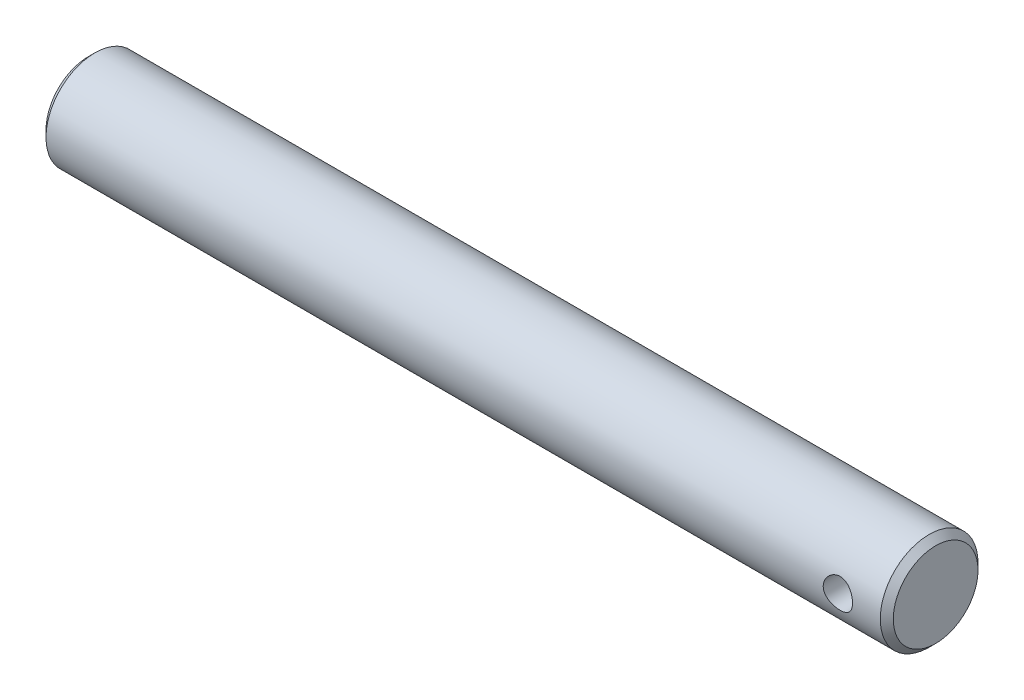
from build123d import *

# Parameters (mm, degrees)
ESQUISSE1_W             = 130
ESQUISSE1_H             = 7.5
ESQUISSE2_R             = 2.25
ENL_V_MAT_EXTRU_1_DEPTH = 50
CHANFREIN1_SIZE         = 1


with BuildPart() as part:
    # Esquisse1 → Base-R_volution (revolve)
    with BuildSketch(Plane.XY, mode=Mode.PRIVATE) as base_r_volution_sk:
        with Locations((-65, 3.75)):
            Rectangle(ESQUISSE1_W, ESQUISSE1_H)
    revolve(base_r_volution_sk.sketch.rotate(Axis((40, 0, 0), (-1, 0, 0)), 90), axis=Axis((40, 0, 0), (-1, 0, 0)))

    # Esquisse2 → Enl_v. mat.-Extru.1 (cut, symmetric)
    with BuildSketch(Plane.XY):
        with Locations((-7.5, 0)):
            Circle(ESQUISSE2_R)
    extrude(amount=ENL_V_MAT_EXTRU_1_DEPTH, both=True, mode=Mode.SUBTRACT)

    # Chanfrein1
    chanfrein1_edges = [part.edges().sort_by_distance(p)[0] for p in [
        (-130, 0, 7.5),
        (0, 0, 7.5),
    ]]
    chamfer(chanfrein1_edges, length=CHANFREIN1_SIZE)


solid = part.part
